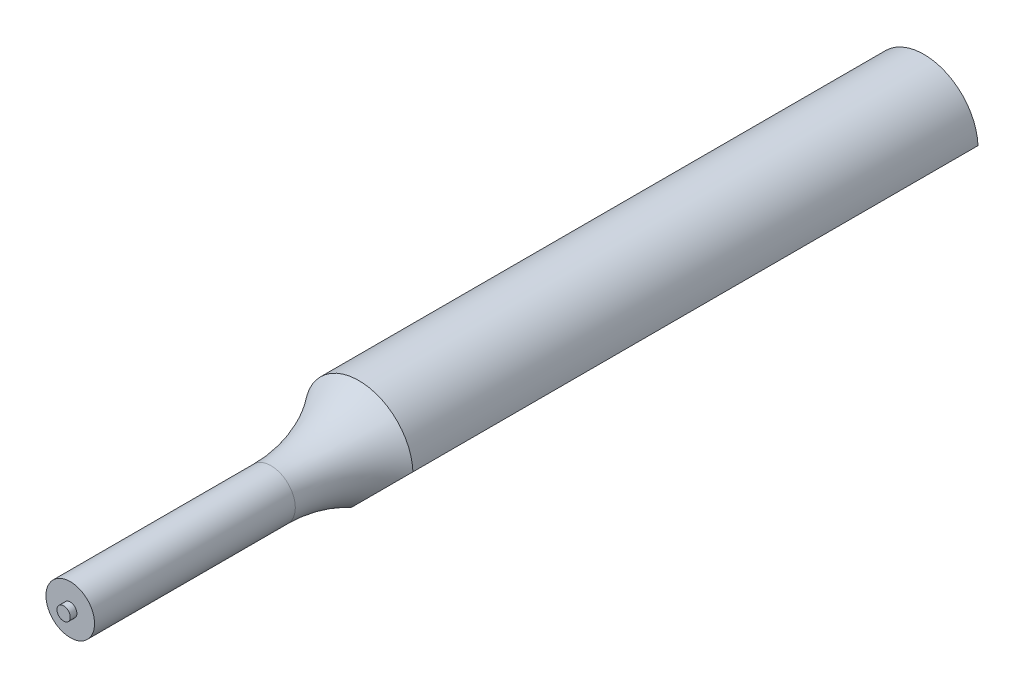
ISO-10303-21;
HEADER;
FILE_DESCRIPTION(('STEP AP214'),'2;1');
FILE_NAME('part.step','',(''),(''),'','','');
FILE_SCHEMA(('AUTOMOTIVE_DESIGN { 1 0 10303 214 1 1 1 1 }'));
ENDSEC;
DATA;
#1=APPLICATION_CONTEXT('core data for automotive mechanical design processes');
#2=APPLICATION_PROTOCOL_DEFINITION('international standard','automotive_design',2000,#1);
#3=PRODUCT_CONTEXT('',#1,'mechanical');
#4=PRODUCT('Part','Part','',(#3));
#5=PRODUCT_RELATED_PRODUCT_CATEGORY('part','',(#4));
#6=PRODUCT_DEFINITION_FORMATION('','',#4);
#7=PRODUCT_DEFINITION_CONTEXT('part definition',#1,'design');
#8=PRODUCT_DEFINITION('design','',#6,#7);
#9=PRODUCT_DEFINITION_SHAPE('','',#8);
#10=(LENGTH_UNIT() NAMED_UNIT(*) SI_UNIT(.MILLI.,.METRE.));
#11=(NAMED_UNIT(*) PLANE_ANGLE_UNIT() SI_UNIT($,.RADIAN.));
#12=(NAMED_UNIT(*) SI_UNIT($,.STERADIAN.) SOLID_ANGLE_UNIT());
#13=UNCERTAINTY_MEASURE_WITH_UNIT(LENGTH_MEASURE(1.E-05),#10,'distance_accuracy_value','');
#14=(GEOMETRIC_REPRESENTATION_CONTEXT(3) GLOBAL_UNCERTAINTY_ASSIGNED_CONTEXT((#13)) GLOBAL_UNIT_ASSIGNED_CONTEXT((#10,
#11,#12)) REPRESENTATION_CONTEXT('',''));
#15=CARTESIAN_POINT('',(0.,0.,0.));
#16=DIRECTION('',(0.,0.,1.));
#17=DIRECTION('',(1.,0.,0.));
#18=AXIS2_PLACEMENT_3D('',#15,#16,#17);
#19=CARTESIAN_POINT('',(-4.7625,2.91433543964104E-13,6.34999999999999));
#20=DIRECTION('',(0.,0.,1.));
#21=DIRECTION('',(1.00000000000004,0.,0.));
#22=AXIS2_PLACEMENT_3D('',#19,#20,#21);
#23=PLANE('',#22);
#24=CARTESIAN_POINT('',(0.,0.,6.34999999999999));
#25=DIRECTION('',(0.,0.,1.));
#26=DIRECTION('',(1.00000000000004,0.,0.));
#27=AXIS2_PLACEMENT_3D('',#24,#25,#26);
#28=CIRCLE('',#27,4.7625);
#29=CARTESIAN_POINT('',(4.75912751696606,0.179196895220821,6.34999999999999));
#30=VERTEX_POINT('',#29);
#31=CARTESIAN_POINT('',(-0.179196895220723,-4.75912751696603,6.34999999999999));
#32=VERTEX_POINT('',#31);
#33=EDGE_CURVE('E93',#30,#32,#28,.T.);
#34=ORIENTED_EDGE('',*,*,#33,.F.);
#35=DIRECTION('',(0.707106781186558,0.707106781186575,0.));
#36=VECTOR('',#35,1.);
#37=CARTESIAN_POINT('',(-0.179196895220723,-4.75912751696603,6.34999999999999));
#38=LINE('',#37,#36);
#39=EDGE_CURVE('E84',#32,#30,#38,.T.);
#40=ORIENTED_EDGE('',*,*,#39,.F.);
#41=EDGE_LOOP('',(#34,#40));
#42=FACE_BOUND('',#41,.T.);
#43=ADVANCED_FACE('F43',(#42),#23,.F.);
#44=CARTESIAN_POINT('',(0.,-2.91433543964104E-13,43.5171681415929));
#45=DIRECTION('',(0.,0.,1.));
#46=DIRECTION('',(1.00000000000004,0.,0.));
#47=AXIS2_PLACEMENT_3D('',#44,#45,#46);
#48=CYLINDRICAL_SURFACE('',#47,4.7625);
#49=CARTESIAN_POINT('',(-4.00248276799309,-2.58099553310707,25.5899742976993));
#50=CARTESIAN_POINT('',(-4.02522274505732,-2.54572828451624,25.4458852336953));
#51=CARTESIAN_POINT('',(-4.04766248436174,-2.50991005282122,25.3018835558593));
#52=CARTESIAN_POINT('',(-4.09193875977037,-2.43706039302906,25.0140898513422));
#53=CARTESIAN_POINT('',(-4.11377527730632,-2.40002892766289,24.8702978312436));
#54=CARTESIAN_POINT('',(-4.17842422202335,-2.28686292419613,24.4389656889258));
#55=CARTESIAN_POINT('',(-4.22032281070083,-2.208738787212,24.1518068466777));
#56=CARTESIAN_POINT('',(-4.30289135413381,-2.04337310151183,23.5701936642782));
#57=CARTESIAN_POINT('',(-4.34348400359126,-1.95592516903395,23.2757862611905));
#58=CARTESIAN_POINT('',(-4.40231523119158,-1.81755804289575,22.8362623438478));
#59=CARTESIAN_POINT('',(-4.42157721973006,-1.7702517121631,22.6901456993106));
#60=CARTESIAN_POINT('',(-4.45939906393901,-1.67269546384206,22.3988113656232));
#61=CARTESIAN_POINT('',(-4.47795895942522,-1.6224457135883,22.2535936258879));
#62=CARTESIAN_POINT('',(-4.51421091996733,-1.5186537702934,21.9654674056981));
#63=CARTESIAN_POINT('',(-4.53190845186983,-1.46513911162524,21.8225497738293));
#64=CARTESIAN_POINT('',(-4.56654626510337,-1.35332620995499,21.5383567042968));
#65=CARTESIAN_POINT('',(-4.58348590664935,-1.29502403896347,21.397082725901));
#66=CARTESIAN_POINT('',(-4.61637705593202,-1.17239285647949,21.1183156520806));
#67=CARTESIAN_POINT('',(-4.63233524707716,-1.10811446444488,20.9808016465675));
#68=CARTESIAN_POINT('',(-4.65547688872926,-1.00457578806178,20.7781751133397));
#69=CARTESIAN_POINT('',(-4.6630535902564,-0.968901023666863,20.7112817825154));
#70=CARTESIAN_POINT('',(-4.67789630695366,-0.894504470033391,20.5791865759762));
#71=CARTESIAN_POINT('',(-4.68516243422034,-0.855783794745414,20.5139840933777));
#72=CARTESIAN_POINT('',(-4.69900506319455,-0.776095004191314,20.3887909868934));
#73=CARTESIAN_POINT('',(-4.70559777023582,-0.735293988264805,20.3286967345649));
#74=CARTESIAN_POINT('',(-4.71831471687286,-0.648721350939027,20.2119385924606));
#75=CARTESIAN_POINT('',(-4.72443847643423,-0.602944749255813,20.1552782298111));
#76=CARTESIAN_POINT('',(-4.73461183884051,-0.516039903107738,20.0605266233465));
#77=CARTESIAN_POINT('',(-4.7388123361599,-0.476312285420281,20.0211841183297));
#78=CARTESIAN_POINT('',(-4.7465537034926,-0.391706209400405,19.9483523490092));
#79=CARTESIAN_POINT('',(-4.75009652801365,-0.346843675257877,19.9148457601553));
#80=CARTESIAN_POINT('',(-4.75485366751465,-0.271185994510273,19.8697074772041));
#81=CARTESIAN_POINT('',(-4.75642103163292,-0.242395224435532,19.8547986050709));
#82=CARTESIAN_POINT('',(-4.75908055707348,-0.18287471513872,19.8294654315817));
#83=CARTESIAN_POINT('',(-4.76017339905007,-0.152147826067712,19.8190347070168));
#84=CARTESIAN_POINT('',(-4.76177604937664,-0.0888993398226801,19.8037279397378));
#85=CARTESIAN_POINT('',(-4.76227899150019,-0.0563611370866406,19.798917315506));
#86=CARTESIAN_POINT('',(-4.76260340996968,0.00902995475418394,19.7958150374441));
#87=CARTESIAN_POINT('',(-4.76242519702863,0.0418826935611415,19.7975204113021));
#88=CARTESIAN_POINT('',(-4.76148382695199,0.102334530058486,19.8065183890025));
#89=CARTESIAN_POINT('',(-4.7608008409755,0.130055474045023,19.8130451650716));
#90=CARTESIAN_POINT('',(-4.7590133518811,0.184209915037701,19.8301024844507));
#91=CARTESIAN_POINT('',(-4.75790856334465,0.210642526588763,19.8406357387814));
#92=CARTESIAN_POINT('',(-4.75451686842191,0.278927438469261,19.872912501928));
#93=CARTESIAN_POINT('',(-4.75193127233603,0.319424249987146,19.8974639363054));
#94=CARTESIAN_POINT('',(-4.7461389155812,0.396318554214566,19.9522424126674));
#95=CARTESIAN_POINT('',(-4.74293008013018,0.432701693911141,19.9824884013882));
#96=CARTESIAN_POINT('',(-4.73499245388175,0.513203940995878,20.0569725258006));
#97=CARTESIAN_POINT('',(-4.73010748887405,0.55602604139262,20.1025746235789));
#98=CARTESIAN_POINT('',(-4.71986086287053,0.637172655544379,20.197616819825));
#99=CARTESIAN_POINT('',(-4.71449821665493,0.675487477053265,20.2470648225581));
#100=CARTESIAN_POINT('',(-4.70340177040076,0.748866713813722,20.3487083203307));
#101=CARTESIAN_POINT('',(-4.69766592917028,0.783910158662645,20.4009185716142));
#102=CARTESIAN_POINT('',(-4.68593561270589,0.851218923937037,20.5069737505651));
#103=CARTESIAN_POINT('',(-4.67994141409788,0.883487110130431,20.560816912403));
#104=CARTESIAN_POINT('',(-4.66114450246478,0.979561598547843,20.7285108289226));
#105=CARTESIAN_POINT('',(-4.6479805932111,1.03978917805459,20.8443637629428));
#106=CARTESIAN_POINT('',(-4.62093036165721,1.15404642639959,21.0790294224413));
#107=CARTESIAN_POINT('',(-4.60704349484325,1.20807132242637,21.1978443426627));
#108=CARTESIAN_POINT('',(-4.57861833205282,1.31169886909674,21.4376273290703));
#109=CARTESIAN_POINT('',(-4.56407861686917,1.36129110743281,21.558599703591));
#110=CARTESIAN_POINT('',(-4.53443167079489,1.45699481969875,21.8018508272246));
#111=CARTESIAN_POINT('',(-4.51932436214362,1.5031058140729,21.9241297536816));
#112=CARTESIAN_POINT('',(-4.47317602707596,1.63741284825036,22.2925795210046));
#113=CARTESIAN_POINT('',(-4.44133411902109,1.72149334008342,22.5401476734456));
#114=CARTESIAN_POINT('',(-4.37570545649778,1.88203802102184,23.0370801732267));
#115=CARTESIAN_POINT('',(-4.34192128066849,1.9585119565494,23.2864417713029));
#116=CARTESIAN_POINT('',(-4.28345233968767,2.0824322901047,23.7072575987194));
#117=CARTESIAN_POINT('',(-4.25927962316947,2.13139306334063,23.8783397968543));
#118=CARTESIAN_POINT('',(-4.21004355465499,2.22706881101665,24.2210676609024));
#119=CARTESIAN_POINT('',(-4.18497989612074,2.27378299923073,24.3927135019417));
#120=CARTESIAN_POINT('',(-4.13416422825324,2.36490929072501,24.7351547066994));
#121=CARTESIAN_POINT('',(-4.10841851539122,2.40933561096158,24.9059472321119));
#122=CARTESIAN_POINT('',(-4.056083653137,2.49642929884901,25.2477782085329));
#123=CARTESIAN_POINT('',(-4.02949484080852,2.53909735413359,25.4188165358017));
#124=CARTESIAN_POINT('',(-4.00248276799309,2.58099553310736,25.5899742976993));
#125=B_SPLINE_CURVE_WITH_KNOTS('',3,(#49,#50,#51,#52,#53,#54,#55,#56,#57,#58,#59,#60,#61,#62,
#63,#64,#65,#66,#67,#68,#69,#70,#71,#72,#73,#74,#75,#76,#77,#78,#79,#80,#81,#82,#83,#84,#85,#86,
#87,#88,#89,#90,#91,#92,#93,#94,#95,#96,#97,#98,#99,#100,#101,#102,#103,#104,#105,#106,#107,
#108,#109,#110,#111,#112,#113,#114,#115,#116,#117,#118,#119,#120,#121,#122,#123,#124),
.UNSPECIFIED.,.F.,.F.,(4,2,2,2,2,2,2,2,2,2,2,2,2,2,2,2,2,2,2,2,2,2,2,2,2,2,2,2,2,2,2,2,2,2,2,2,
2,4),(0.,0.45022368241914,0.900461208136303,1.80198981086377,2.73121839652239,3.19555454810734,
3.65986432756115,4.12069011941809,4.58189785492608,5.03950398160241,5.26801623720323,
5.49644530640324,5.71509848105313,5.93397256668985,6.10186830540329,6.26925680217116,
6.36634972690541,6.46330291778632,6.56137375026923,6.65939985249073,6.74450925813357,
6.82967635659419,6.97113428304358,7.11307145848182,7.30085351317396,7.48903225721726,
7.67834456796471,7.86745898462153,8.26082824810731,8.65449819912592,9.04906982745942,
9.44369571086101,10.2336515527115,11.0225818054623,11.5613172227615,12.1002398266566,
12.6352611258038,13.1700711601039),.UNSPECIFIED.);
#126=CARTESIAN_POINT('',(-4.00251433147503,-2.58094658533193,25.5897742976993));
#127=VERTEX_POINT('',#126);
#128=CARTESIAN_POINT('',(-4.00251433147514,2.58094658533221,25.5897742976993));
#129=VERTEX_POINT('',#128);
#130=EDGE_CURVE('E98',#127,#129,#125,.T.);
#131=ORIENTED_EDGE('',*,*,#130,.T.);
#132=CARTESIAN_POINT('',(-4.00254589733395,2.58089763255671,25.5895742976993));
#133=CARTESIAN_POINT('',(-3.98374375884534,2.60998992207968,25.7085089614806));
#134=CARTESIAN_POINT('',(-3.96748136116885,2.63457728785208,25.8289263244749));
#135=CARTESIAN_POINT('',(-3.94038015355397,2.67497554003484,26.0718070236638));
#136=CARTESIAN_POINT('',(-3.92954040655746,2.69078794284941,26.1942700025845));
#137=CARTESIAN_POINT('',(-3.9136110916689,2.71389516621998,26.4405308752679));
#138=CARTESIAN_POINT('',(-3.90852933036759,2.72117842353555,26.5643303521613));
#139=CARTESIAN_POINT('',(-3.90427351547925,2.72728344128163,26.8122429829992));
#140=CARTESIAN_POINT('',(-3.90509966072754,2.72610491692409,26.9363561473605));
#141=CARTESIAN_POINT('',(-3.91263956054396,2.71527160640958,27.1840148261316));
#142=CARTESIAN_POINT('',(-3.91935240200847,2.70561813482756,27.3075604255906));
#143=CARTESIAN_POINT('',(-3.93847587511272,2.67770423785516,27.5532288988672));
#144=CARTESIAN_POINT('',(-3.95088636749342,2.65944402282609,27.6753518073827));
#145=CARTESIAN_POINT('',(-3.98104683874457,2.61408047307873,27.9172203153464));
#146=CARTESIAN_POINT('',(-3.99879400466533,2.58698179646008,28.0369671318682));
#147=CARTESIAN_POINT('',(-4.03908679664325,2.52360498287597,28.273134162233));
#148=CARTESIAN_POINT('',(-4.06163140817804,2.48732878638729,28.389555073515));
#149=CARTESIAN_POINT('',(-4.12599014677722,2.37984742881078,28.6884472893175));
#150=CARTESIAN_POINT('',(-4.17112887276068,2.30088062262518,28.8675134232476));
#151=CARTESIAN_POINT('',(-4.2680059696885,2.11575024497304,29.2089690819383));
#152=CARTESIAN_POINT('',(-4.3197350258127,2.00962485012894,29.3713815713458));
#153=CARTESIAN_POINT('',(-4.41179643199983,1.79654634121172,29.6377503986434));
#154=CARTESIAN_POINT('',(-4.45197592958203,1.69554739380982,29.7465098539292));
#155=CARTESIAN_POINT('',(-4.5293720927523,1.47636257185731,29.9464000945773));
#156=CARTESIAN_POINT('',(-4.56659240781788,1.35819839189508,30.0375527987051));
#157=CARTESIAN_POINT('',(-4.62821149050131,1.12811168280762,30.1836146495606));
#158=CARTESIAN_POINT('',(-4.65371391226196,1.01875109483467,30.24207914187));
#159=CARTESIAN_POINT('',(-4.69779369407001,0.790925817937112,30.3413201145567));
#160=CARTESIAN_POINT('',(-4.71637478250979,0.67246607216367,30.3821061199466));
#161=CARTESIAN_POINT('',(-4.74475995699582,0.428694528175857,30.443858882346));
#162=CARTESIAN_POINT('',(-4.75451473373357,0.303348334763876,30.4647143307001));
#163=CARTESIAN_POINT('',(-4.76390815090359,0.050559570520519,30.4848051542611));
#164=CARTESIAN_POINT('',(-4.76355020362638,-0.0768822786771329,30.4840478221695));
#165=CARTESIAN_POINT('',(-4.75329311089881,-0.317392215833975,30.4620934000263));
#166=CARTESIAN_POINT('',(-4.74429606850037,-0.430683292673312,30.4428287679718));
#167=CARTESIAN_POINT('',(-4.71894195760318,-0.6522530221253,30.3877099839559));
#168=CARTESIAN_POINT('',(-4.70258455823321,-0.760531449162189,30.3518550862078));
#169=CARTESIAN_POINT('',(-4.66330563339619,-0.973175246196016,30.2638488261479));
#170=CARTESIAN_POINT('',(-4.64018762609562,-1.07729822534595,30.211204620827));
#171=CARTESIAN_POINT('',(-4.58947983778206,-1.27618080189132,30.0922461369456));
#172=CARTESIAN_POINT('',(-4.56188760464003,-1.3709352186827,30.0259243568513));
#173=CARTESIAN_POINT('',(-4.49143364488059,-1.58958928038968,29.8501826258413));
#174=CARTESIAN_POINT('',(-4.44717375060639,-1.70809786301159,29.7346031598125));
#175=CARTESIAN_POINT('',(-4.35815364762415,-1.92395867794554,29.4851764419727));
#176=CARTESIAN_POINT('',(-4.31339259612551,-2.02126682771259,29.3512920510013));
#177=CARTESIAN_POINT('',(-4.24290600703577,-2.16402085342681,29.1208013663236));
#178=CARTESIAN_POINT('',(-4.21613704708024,-2.21551450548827,29.0281636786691));
#179=CARTESIAN_POINT('',(-4.16482653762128,-2.31052950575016,28.8382975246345));
#180=CARTESIAN_POINT('',(-4.14028482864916,-2.35405142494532,28.7410693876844));
#181=CARTESIAN_POINT('',(-4.09409857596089,-2.43349021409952,28.5428191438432));
#182=CARTESIAN_POINT('',(-4.07245623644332,-2.46940130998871,28.4417942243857));
#183=CARTESIAN_POINT('',(-4.0326465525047,-2.53389098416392,28.2368120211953));
#184=CARTESIAN_POINT('',(-4.01447795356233,-2.56247221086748,28.1328558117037));
#185=CARTESIAN_POINT('',(-3.98181382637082,-2.61294496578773,27.9211990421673));
#186=CARTESIAN_POINT('',(-3.96737317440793,-2.63473742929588,27.8134664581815));
#187=CARTESIAN_POINT('',(-3.94284282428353,-2.67130703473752,27.5963625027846));
#188=CARTESIAN_POINT('',(-3.93275194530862,-2.68608608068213,27.4869915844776));
#189=CARTESIAN_POINT('',(-3.91714549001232,-2.70879438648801,27.2672473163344));
#190=CARTESIAN_POINT('',(-3.91162878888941,-2.71672533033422,27.156874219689));
#191=CARTESIAN_POINT('',(-3.90529036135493,-2.72582921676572,26.9357506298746));
#192=CARTESIAN_POINT('',(-3.90446703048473,-2.72700446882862,26.825000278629));
#193=CARTESIAN_POINT('',(-3.90731263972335,-2.72292436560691,26.6192513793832));
#194=CARTESIAN_POINT('',(-3.91036684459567,-2.71854905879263,26.524225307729));
#195=CARTESIAN_POINT('',(-3.91990046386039,-2.70478376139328,26.3347183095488));
#196=CARTESIAN_POINT('',(-3.92637946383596,-2.69539437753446,26.2402373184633));
#197=CARTESIAN_POINT('',(-3.94265537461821,-2.67153358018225,26.0522515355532));
#198=CARTESIAN_POINT('',(-3.95245071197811,-2.6570645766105,25.9587463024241));
#199=CARTESIAN_POINT('',(-3.97518478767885,-2.62291841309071,25.7730593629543));
#200=CARTESIAN_POINT('',(-3.98812417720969,-2.6032401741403,25.680877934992));
#201=CARTESIAN_POINT('',(-4.00254589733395,-2.58089763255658,25.5895742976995));
#202=B_SPLINE_CURVE_WITH_KNOTS('',3,(#132,#133,#134,#135,#136,#137,#138,#139,#140,#141,#142,
#143,#144,#145,#146,#147,#148,#149,#150,#151,#152,#153,#154,#155,#156,#157,#158,#159,#160,#161,
#162,#163,#164,#165,#166,#167,#168,#169,#170,#171,#172,#173,#174,#175,#176,#177,#178,#179,#180,
#181,#182,#183,#184,#185,#186,#187,#188,#189,#190,#191,#192,#193,#194,#195,#196,#197,#198,#199,
#200,#201),.UNSPECIFIED.,.F.,.F.,(4,2,2,2,2,2,2,2,2,2,2,2,2,2,2,2,2,2,2,2,2,2,2,2,2,2,2,2,2,2,2,
2,2,2,4),(0.,0.371484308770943,0.742904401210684,1.11482745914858,1.48676303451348,
1.8586409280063,2.23050973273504,2.60218286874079,2.9737774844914,3.57386840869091,
4.17312037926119,4.63274823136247,5.09180014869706,5.47005609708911,5.84810799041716,
6.22825910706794,6.60828195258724,6.95250087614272,7.29673527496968,7.65218390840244,
8.00782801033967,8.51910286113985,9.03143088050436,9.35899799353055,9.68654163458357,
10.0143328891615,10.3420055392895,10.6742571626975,11.0064185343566,11.3384982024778,
11.6704643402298,11.9558029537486,12.2411070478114,12.5262759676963,12.8115040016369),.UNSPECIFIED.);
#203=EDGE_CURVE('E57',#129,#127,#202,.T.);
#204=ORIENTED_EDGE('',*,*,#203,.T.);
#205=EDGE_LOOP('',(#131,#204));
#206=FACE_BOUND('',#205,.T.);
#207=ORIENTED_EDGE('',*,*,#33,.T.);
#208=DIRECTION('',(0.,0.,-1.));
#209=VECTOR('',#208,1.);
#210=CARTESIAN_POINT('',(-0.179196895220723,-4.75912751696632,82.0674));
#211=LINE('',#210,#209);
#212=CARTESIAN_POINT('',(-0.179196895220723,-4.75912751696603,56.083200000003));
#213=VERTEX_POINT('',#212);
#214=EDGE_CURVE('E81',#213,#32,#211,.T.);
#215=ORIENTED_EDGE('',*,*,#214,.F.);
#216=CARTESIAN_POINT('',(0.,0.,56.0832));
#217=DIRECTION('',(0.,0.,1.));
#218=DIRECTION('',(1.00000000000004,0.,0.));
#219=AXIS2_PLACEMENT_3D('',#216,#217,#218);
#220=CIRCLE('',#219,4.76249999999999);
#221=CARTESIAN_POINT('',(4.75912751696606,0.179196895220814,56.0832));
#222=VERTEX_POINT('',#221);
#223=EDGE_CURVE('E99',#222,#213,#220,.T.);
#224=ORIENTED_EDGE('',*,*,#223,.F.);
#225=DIRECTION('',(0.,0.,-1.));
#226=VECTOR('',#225,1.);
#227=CARTESIAN_POINT('',(4.75912751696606,0.179196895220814,82.0674));
#228=LINE('',#227,#226);
#229=EDGE_CURVE('E64',#222,#30,#228,.T.);
#230=ORIENTED_EDGE('',*,*,#229,.T.);
#231=EDGE_LOOP('',(#207,#215,#224,#230));
#232=FACE_BOUND('',#231,.T.);
#233=ADVANCED_FACE('F96',(#206,#232),#48,.T.);
#234=CARTESIAN_POINT('',(0.,0.,63.8136978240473));
#235=DIRECTION('',(0.,0.,1.));
#236=DIRECTION('',(1.00000000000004,0.,0.));
#237=AXIS2_PLACEMENT_3D('',#234,#235,#236);
#238=TOROIDAL_SURFACE('',#237,14.83868,12.7);
#239=CARTESIAN_POINT('',(0.,0.,63.8136978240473));
#240=DIRECTION('',(0.,0.,1.));
#241=DIRECTION('',(1.00000000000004,0.,0.));
#242=AXIS2_PLACEMENT_3D('',#239,#240,#241);
#243=CIRCLE('',#242,2.13867999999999);
#244=CARTESIAN_POINT('',(2.13868000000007,0.,63.8136978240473));
#245=VERTEX_POINT('',#244);
#246=EDGE_CURVE('E106',#245,#245,#243,.T.);
#247=ORIENTED_EDGE('',*,*,#246,.F.);
#248=EDGE_LOOP('',(#247));
#249=FACE_BOUND('',#248,.T.);
#250=ORIENTED_EDGE('',*,*,#223,.T.);
#251=CARTESIAN_POINT('',(-0.179344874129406,-4.75927549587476,56.083));
#252=CARTESIAN_POINT('',(-0.135728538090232,-4.71565915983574,56.141946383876));
#253=CARTESIAN_POINT('',(-0.0922378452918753,-4.67216846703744,56.2010777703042));
#254=CARTESIAN_POINT('',(-0.00544852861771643,-4.58537915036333,56.319620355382));
#255=CARTESIAN_POINT('',(0.0378500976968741,-4.54208052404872,56.3790315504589));
#256=CARTESIAN_POINT('',(0.167572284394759,-4.41235833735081,56.5575847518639));
#257=CARTESIAN_POINT('',(0.253798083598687,-4.32613253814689,56.6770136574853));
#258=CARTESIAN_POINT('',(0.427450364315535,-4.15248025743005,56.917175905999));
#259=CARTESIAN_POINT('',(0.514878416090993,-4.0650522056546,57.0379069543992));
#260=CARTESIAN_POINT('',(0.690815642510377,-3.88911497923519,57.2777567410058));
#261=CARTESIAN_POINT('',(0.77932459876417,-3.80060602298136,57.3968757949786));
#262=CARTESIAN_POINT('',(0.92264236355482,-3.65728825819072,57.5839148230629));
#263=CARTESIAN_POINT('',(0.976628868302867,-3.60330175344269,57.6530877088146));
#264=CARTESIAN_POINT('',(1.08596086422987,-3.4939697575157,57.7893125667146));
#265=CARTESIAN_POINT('',(1.14130674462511,-3.43862387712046,57.8563639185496));
#266=CARTESIAN_POINT('',(1.25373499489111,-3.32619562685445,57.9870833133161));
#267=CARTESIAN_POINT('',(1.31081239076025,-3.26911823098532,58.0507598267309));
#268=CARTESIAN_POINT('',(1.42748404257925,-3.1524465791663,58.1732790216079));
#269=CARTESIAN_POINT('',(1.4870766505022,-3.09285397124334,58.2321247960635));
#270=CARTESIAN_POINT('',(1.61188232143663,-2.96804830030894,58.34465435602));
#271=CARTESIAN_POINT('',(1.677222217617,-2.90270840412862,58.3980629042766));
#272=CARTESIAN_POINT('',(1.81218719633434,-2.76774342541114,58.4928224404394));
#273=CARTESIAN_POINT('',(1.88180504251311,-2.69812557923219,58.534193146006));
#274=CARTESIAN_POINT('',(2.01158640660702,-2.56834421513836,58.5929818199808));
#275=CARTESIAN_POINT('',(2.07103517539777,-2.50889544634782,58.6134562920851));
#276=CARTESIAN_POINT('',(2.19149645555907,-2.38843416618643,58.6397455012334));
#277=CARTESIAN_POINT('',(2.25250577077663,-2.32742485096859,58.6455881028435));
#278=CARTESIAN_POINT('',(2.37434923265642,-2.20558138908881,58.6416397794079));
#279=CARTESIAN_POINT('',(2.43518296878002,-2.14474765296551,58.6318249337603));
#280=CARTESIAN_POINT('',(2.55489061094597,-2.02504001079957,58.5982002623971));
#281=CARTESIAN_POINT('',(2.61376147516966,-1.96616914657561,58.5743696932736));
#282=CARTESIAN_POINT('',(2.71815362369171,-1.86177699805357,58.5212074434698));
#283=CARTESIAN_POINT('',(2.76415140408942,-1.81577921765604,58.4936717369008));
#284=CARTESIAN_POINT('',(2.85428055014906,-1.72565007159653,58.432994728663));
#285=CARTESIAN_POINT('',(2.89841038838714,-1.68152023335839,58.3998489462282));
#286=CARTESIAN_POINT('',(2.98539910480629,-1.59453151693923,58.3289608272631));
#287=CARTESIAN_POINT('',(3.02823894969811,-1.55169167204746,58.2911724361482));
#288=CARTESIAN_POINT('',(3.1123732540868,-1.46755736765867,58.2123852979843));
#289=CARTESIAN_POINT('',(3.15366839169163,-1.42626223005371,58.1713879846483));
#290=CARTESIAN_POINT('',(3.26887281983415,-1.31105780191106,58.0518462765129));
#291=CARTESIAN_POINT('',(3.34130275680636,-1.23862786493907,57.9704665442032));
#292=CARTESIAN_POINT('',(3.4833491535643,-1.09658146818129,57.8029066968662));
#293=CARTESIAN_POINT('',(3.55296363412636,-1.02696698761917,57.7167233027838));
#294=CARTESIAN_POINT('',(3.69055332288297,-0.88937729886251,57.5412775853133));
#295=CARTESIAN_POINT('',(3.75852361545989,-0.821407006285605,57.4520076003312));
#296=CARTESIAN_POINT('',(3.8933919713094,-0.686538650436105,57.2718597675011));
#297=CARTESIAN_POINT('',(3.96028994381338,-0.619640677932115,57.1809817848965));
#298=CARTESIAN_POINT('',(4.08823178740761,-0.49169883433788,57.0057720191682));
#299=CARTESIAN_POINT('',(4.14931566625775,-0.430614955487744,56.9214984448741));
#300=CARTESIAN_POINT('',(4.2713730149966,-0.308557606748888,56.7527804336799));
#301=CARTESIAN_POINT('',(4.33234647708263,-0.247584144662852,56.6683359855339));
#302=CARTESIAN_POINT('',(4.45410752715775,-0.125823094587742,56.5001055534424));
#303=CARTESIAN_POINT('',(4.51489435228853,-0.065036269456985,56.4163184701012));
#304=CARTESIAN_POINT('',(4.63679330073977,0.0568626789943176,56.2492282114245));
#305=CARTESIAN_POINT('',(4.69790540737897,0.117974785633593,56.1659250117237));
#306=CARTESIAN_POINT('',(4.75927549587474,0.179344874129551,56.083));
#307=B_SPLINE_CURVE_WITH_KNOTS('',3,(#251,#252,#253,#254,#255,#256,#257,#258,#259,#260,#261,
#262,#263,#264,#265,#266,#267,#268,#269,#270,#271,#272,#273,#274,#275,#276,#277,#278,#279,#280,
#281,#282,#283,#284,#285,#286,#287,#288,#289,#290,#291,#292,#293,#294,#295,#296,#297,#298,#299,
#300,#301,#302,#303,#304,#305,#306),.UNSPECIFIED.,.F.,.F.,(4,2,2,2,2,2,2,2,2,2,2,2,2,2,2,2,2,2,
2,2,2,2,2,2,2,2,2,4),(0.,0.255957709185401,0.511912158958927,1.0239626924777,1.54239529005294,
2.06072481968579,2.36977147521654,2.67890767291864,2.98722715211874,3.29534765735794,
3.61498760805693,3.93410101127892,4.19262292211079,4.45065213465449,4.70907592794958,
4.96788315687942,5.17948879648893,5.39126424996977,5.60534205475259,5.81932475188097,
6.21151186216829,6.60397004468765,6.99748437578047,7.39103184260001,7.75308145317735,
8.11515572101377,8.47528355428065,8.83539309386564),.UNSPECIFIED.);
#308=EDGE_CURVE('E11',#213,#222,#307,.T.);
#309=ORIENTED_EDGE('',*,*,#308,.T.);
#310=EDGE_LOOP('',(#250,#309));
#311=FACE_BOUND('',#310,.T.);
#312=ADVANCED_FACE('F149',(#249,#311),#238,.F.);
#313=CARTESIAN_POINT('',(0.,-2.91433543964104E-13,43.5171681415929));
#314=DIRECTION('',(0.,0.,1.));
#315=DIRECTION('',(1.00000000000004,0.,0.));
#316=AXIS2_PLACEMENT_3D('',#313,#314,#315);
#317=CYLINDRICAL_SURFACE('',#316,2.13867999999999);
#318=CARTESIAN_POINT('',(0.,0.,81.4832));
#319=DIRECTION('',(0.,0.,1.));
#320=DIRECTION('',(1.00000000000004,0.,0.));
#321=AXIS2_PLACEMENT_3D('',#318,#319,#320);
#322=CIRCLE('',#321,2.13867999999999);
#323=CARTESIAN_POINT('',(2.13868000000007,0.,81.4832));
#324=VERTEX_POINT('',#323);
#325=EDGE_CURVE('E113',#324,#324,#322,.T.);
#326=ORIENTED_EDGE('',*,*,#325,.F.);
#327=EDGE_LOOP('',(#326));
#328=FACE_BOUND('',#327,.T.);
#329=ORIENTED_EDGE('',*,*,#246,.T.);
#330=EDGE_LOOP('',(#329));
#331=FACE_BOUND('',#330,.T.);
#332=ADVANCED_FACE('F146',(#328,#331),#317,.T.);
#333=CARTESIAN_POINT('',(0.,0.,81.4832));
#334=DIRECTION('',(0.,0.,-1.));
#335=DIRECTION('',(-1.00000000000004,0.,0.));
#336=AXIS2_PLACEMENT_3D('',#333,#334,#335);
#337=PLANE('',#336);
#338=CARTESIAN_POINT('',(0.,0.,81.4832));
#339=DIRECTION('',(0.,0.,-1.));
#340=DIRECTION('',(-1.00000000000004,0.,0.));
#341=AXIS2_PLACEMENT_3D('',#338,#339,#340);
#342=CIRCLE('',#341,0.584200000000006);
#343=CARTESIAN_POINT('',(-0.584200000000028,0.,81.4832));
#344=VERTEX_POINT('',#343);
#345=EDGE_CURVE('E110',#344,#344,#342,.T.);
#346=ORIENTED_EDGE('',*,*,#345,.T.);
#347=EDGE_LOOP('',(#346));
#348=FACE_BOUND('',#347,.T.);
#349=ORIENTED_EDGE('',*,*,#325,.T.);
#350=EDGE_LOOP('',(#349));
#351=FACE_BOUND('',#350,.T.);
#352=ADVANCED_FACE('F139',(#348,#351),#337,.F.);
#353=CARTESIAN_POINT('',(0.,0.,0.));
#354=DIRECTION('',(0.,0.,-1.));
#355=DIRECTION('',(-1.00000000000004,0.,0.));
#356=AXIS2_PLACEMENT_3D('',#353,#354,#355);
#357=CYLINDRICAL_SURFACE('',#356,0.584200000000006);
#358=CARTESIAN_POINT('',(0.,0.,82.0674));
#359=DIRECTION('',(0.,0.,-1.));
#360=DIRECTION('',(-1.00000000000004,0.,0.));
#361=AXIS2_PLACEMENT_3D('',#358,#359,#360);
#362=CIRCLE('',#361,0.584200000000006);
#363=CARTESIAN_POINT('',(-0.584200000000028,0.,82.0674));
#364=VERTEX_POINT('',#363);
#365=EDGE_CURVE('E114',#364,#364,#362,.T.);
#366=ORIENTED_EDGE('',*,*,#365,.T.);
#367=EDGE_LOOP('',(#366));
#368=FACE_BOUND('',#367,.T.);
#369=ORIENTED_EDGE('',*,*,#345,.F.);
#370=EDGE_LOOP('',(#369));
#371=FACE_BOUND('',#370,.T.);
#372=ADVANCED_FACE('F136',(#368,#371),#357,.T.);
#373=CARTESIAN_POINT('',(0.,0.,82.0674));
#374=DIRECTION('',(0.,0.,1.));
#375=DIRECTION('',(1.00000000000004,0.,0.));
#376=AXIS2_PLACEMENT_3D('',#373,#374,#375);
#377=PLANE('',#376);
#378=ORIENTED_EDGE('',*,*,#365,.F.);
#379=EDGE_LOOP('',(#378));
#380=FACE_BOUND('',#379,.T.);
#381=ADVANCED_FACE('F134',(#380),#377,.T.);
#382=CARTESIAN_POINT('',(-7.81050000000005,2.91433543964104E-13,26.8224));
#383=DIRECTION('',(0.,0.,-1.));
#384=DIRECTION('',(-1.00000000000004,0.,0.));
#385=AXIS2_PLACEMENT_3D('',#382,#383,#384);
#386=SPHERICAL_SURFACE('',#385,4.7625);
#387=CARTESIAN_POINT('',(-7.81049999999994,2.91433543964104E-13,25.5897742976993));
#388=DIRECTION('',(0.,0.,-1.));
#389=DIRECTION('',(-1.00000000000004,0.,0.));
#390=AXIS2_PLACEMENT_3D('',#387,#388,#389);
#391=CIRCLE('',#390,4.6002217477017);
#392=EDGE_CURVE('E70',#129,#127,#391,.T.);
#393=ORIENTED_EDGE('',*,*,#392,.T.);
#394=ORIENTED_EDGE('',*,*,#203,.F.);
#395=EDGE_LOOP('',(#393,#394));
#396=FACE_BOUND('',#395,.T.);
#397=ADVANCED_FACE('F129',(#396),#386,.F.);
#398=CARTESIAN_POINT('',(-7.81050000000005,2.91433543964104E-13,8.42151300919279));
#399=DIRECTION('',(0.,0.,1.));
#400=DIRECTION('',(1.00000000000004,0.,0.));
#401=AXIS2_PLACEMENT_3D('',#398,#399,#400);
#402=CONICAL_SURFACE('',#401,0.,0.261799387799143);
#403=ORIENTED_EDGE('',*,*,#392,.F.);
#404=ORIENTED_EDGE('',*,*,#130,.F.);
#405=EDGE_LOOP('',(#403,#404));
#406=FACE_BOUND('',#405,.T.);
#407=ADVANCED_FACE('F126',(#406),#402,.F.);
#408=CARTESIAN_POINT('',(-0.179196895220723,-4.75912751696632,82.0674));
#409=DIRECTION('',(-0.707106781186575,0.707106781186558,0.));
#410=DIRECTION('',(-0.707106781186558,-0.707106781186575,0.));
#411=AXIS2_PLACEMENT_3D('',#408,#409,#410);
#412=PLANE('',#411);
#413=ORIENTED_EDGE('',*,*,#214,.T.);
#414=ORIENTED_EDGE('',*,*,#39,.T.);
#415=ORIENTED_EDGE('',*,*,#229,.F.);
#416=ORIENTED_EDGE('',*,*,#308,.F.);
#417=EDGE_LOOP('',(#413,#414,#415,#416));
#418=FACE_BOUND('',#417,.T.);
#419=ADVANCED_FACE('F83',(#418),#412,.F.);
#420=CLOSED_SHELL('',(#43,#233,#312,#332,#352,#372,#381,#397,#407,#419));
#421=MANIFOLD_SOLID_BREP('B2',#420);
#422=ADVANCED_BREP_SHAPE_REPRESENTATION('',(#18,#421),#14);
#423=SHAPE_DEFINITION_REPRESENTATION(#9,#422);
ENDSEC;
END-ISO-10303-21;
